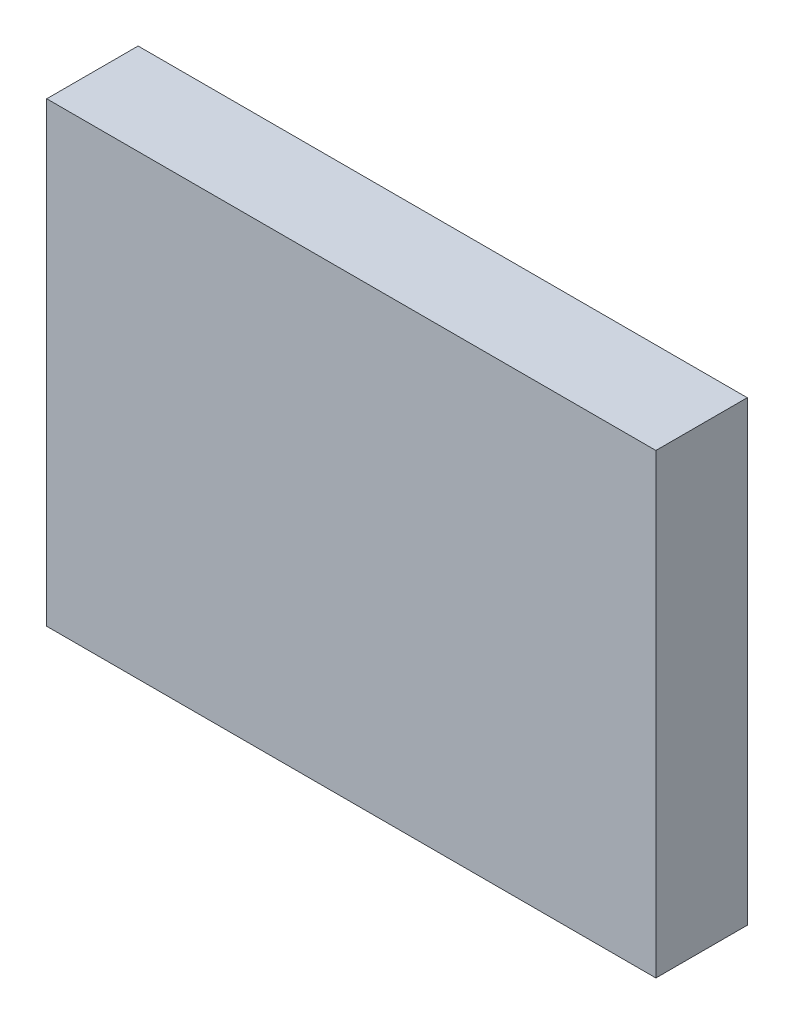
ISO-10303-21;
HEADER;
FILE_DESCRIPTION(('STEP AP214'),'2;1');
FILE_NAME('part.step','',(''),(''),'','','');
FILE_SCHEMA(('AUTOMOTIVE_DESIGN { 1 0 10303 214 1 1 1 1 }'));
ENDSEC;
DATA;
#1=APPLICATION_CONTEXT('core data for automotive mechanical design processes');
#2=APPLICATION_PROTOCOL_DEFINITION('international standard','automotive_design',2000,#1);
#3=PRODUCT_CONTEXT('',#1,'mechanical');
#4=PRODUCT('Part','Part','',(#3));
#5=PRODUCT_RELATED_PRODUCT_CATEGORY('part','',(#4));
#6=PRODUCT_DEFINITION_FORMATION('','',#4);
#7=PRODUCT_DEFINITION_CONTEXT('part definition',#1,'design');
#8=PRODUCT_DEFINITION('design','',#6,#7);
#9=PRODUCT_DEFINITION_SHAPE('','',#8);
#10=(LENGTH_UNIT() NAMED_UNIT(*) SI_UNIT(.MILLI.,.METRE.));
#11=(NAMED_UNIT(*) PLANE_ANGLE_UNIT() SI_UNIT($,.RADIAN.));
#12=(NAMED_UNIT(*) SI_UNIT($,.STERADIAN.) SOLID_ANGLE_UNIT());
#13=UNCERTAINTY_MEASURE_WITH_UNIT(LENGTH_MEASURE(1.E-05),#10,'distance_accuracy_value','');
#14=(GEOMETRIC_REPRESENTATION_CONTEXT(3) GLOBAL_UNCERTAINTY_ASSIGNED_CONTEXT((#13)) GLOBAL_UNIT_ASSIGNED_CONTEXT((#10,
#11,#12)) REPRESENTATION_CONTEXT('',''));
#15=CARTESIAN_POINT('',(0.,0.,0.));
#16=DIRECTION('',(0.,0.,1.));
#17=DIRECTION('',(1.,0.,0.));
#18=AXIS2_PLACEMENT_3D('',#15,#16,#17);
#19=CARTESIAN_POINT('',(0.,0.,6.));
#20=DIRECTION('',(1.,0.,0.));
#21=DIRECTION('',(0.,0.,-1.));
#22=AXIS2_PLACEMENT_3D('',#19,#20,#21);
#23=PLANE('',#22);
#24=DIRECTION('',(0.,-1.,0.));
#25=VECTOR('',#24,1.);
#26=CARTESIAN_POINT('',(0.,0.,0.));
#27=LINE('',#26,#25);
#28=CARTESIAN_POINT('',(0.,30.,0.));
#29=VERTEX_POINT('',#28);
#30=CARTESIAN_POINT('',(0.,0.,0.));
#31=VERTEX_POINT('',#30);
#32=EDGE_CURVE('E102',#29,#31,#27,.T.);
#33=ORIENTED_EDGE('',*,*,#32,.T.);
#34=DIRECTION('',(0.,0.,-1.));
#35=VECTOR('',#34,1.);
#36=CARTESIAN_POINT('',(0.,0.,6.));
#37=LINE('',#36,#35);
#38=CARTESIAN_POINT('',(0.,0.,6.));
#39=VERTEX_POINT('',#38);
#40=EDGE_CURVE('E11',#39,#31,#37,.T.);
#41=ORIENTED_EDGE('',*,*,#40,.F.);
#42=DIRECTION('',(0.,-1.,0.));
#43=VECTOR('',#42,1.);
#44=CARTESIAN_POINT('',(0.,0.,6.));
#45=LINE('',#44,#43);
#46=CARTESIAN_POINT('',(0.,30.,6.));
#47=VERTEX_POINT('',#46);
#48=EDGE_CURVE('E90',#47,#39,#45,.T.);
#49=ORIENTED_EDGE('',*,*,#48,.F.);
#50=DIRECTION('',(0.,0.,-1.));
#51=VECTOR('',#50,1.);
#52=CARTESIAN_POINT('',(0.,30.,6.));
#53=LINE('',#52,#51);
#54=EDGE_CURVE('E98',#47,#29,#53,.T.);
#55=ORIENTED_EDGE('',*,*,#54,.T.);
#56=EDGE_LOOP('',(#33,#41,#49,#55));
#57=FACE_BOUND('',#56,.T.);
#58=ADVANCED_FACE('F39',(#57),#23,.F.);
#59=CARTESIAN_POINT('',(0.,0.,6.));
#60=DIRECTION('',(0.,1.,0.));
#61=DIRECTION('',(0.,0.,1.));
#62=AXIS2_PLACEMENT_3D('',#59,#60,#61);
#63=PLANE('',#62);
#64=DIRECTION('',(1.,0.,0.));
#65=VECTOR('',#64,1.);
#66=CARTESIAN_POINT('',(0.,0.,0.));
#67=LINE('',#66,#65);
#68=CARTESIAN_POINT('',(40.,0.,0.));
#69=VERTEX_POINT('',#68);
#70=EDGE_CURVE('E94',#31,#69,#67,.T.);
#71=ORIENTED_EDGE('',*,*,#70,.T.);
#72=DIRECTION('',(0.,0.,-1.));
#73=VECTOR('',#72,1.);
#74=CARTESIAN_POINT('',(40.,0.,6.));
#75=LINE('',#74,#73);
#76=CARTESIAN_POINT('',(40.,0.,6.));
#77=VERTEX_POINT('',#76);
#78=EDGE_CURVE('E47',#77,#69,#75,.T.);
#79=ORIENTED_EDGE('',*,*,#78,.F.);
#80=DIRECTION('',(1.,0.,0.));
#81=VECTOR('',#80,1.);
#82=CARTESIAN_POINT('',(0.,0.,6.));
#83=LINE('',#82,#81);
#84=EDGE_CURVE('E85',#39,#77,#83,.T.);
#85=ORIENTED_EDGE('',*,*,#84,.F.);
#86=ORIENTED_EDGE('',*,*,#40,.T.);
#87=EDGE_LOOP('',(#71,#79,#85,#86));
#88=FACE_BOUND('',#87,.T.);
#89=ADVANCED_FACE('F93',(#88),#63,.F.);
#90=CARTESIAN_POINT('',(40.,0.,6.));
#91=DIRECTION('',(-1.,0.,0.));
#92=DIRECTION('',(0.,0.,1.));
#93=AXIS2_PLACEMENT_3D('',#90,#91,#92);
#94=PLANE('',#93);
#95=DIRECTION('',(0.,1.,0.));
#96=VECTOR('',#95,1.);
#97=CARTESIAN_POINT('',(40.,0.,0.));
#98=LINE('',#97,#96);
#99=CARTESIAN_POINT('',(40.,30.,0.));
#100=VERTEX_POINT('',#99);
#101=EDGE_CURVE('E72',#69,#100,#98,.T.);
#102=ORIENTED_EDGE('',*,*,#101,.T.);
#103=DIRECTION('',(0.,0.,-1.));
#104=VECTOR('',#103,1.);
#105=CARTESIAN_POINT('',(40.,30.,6.));
#106=LINE('',#105,#104);
#107=CARTESIAN_POINT('',(40.,30.,6.));
#108=VERTEX_POINT('',#107);
#109=EDGE_CURVE('E95',#108,#100,#106,.T.);
#110=ORIENTED_EDGE('',*,*,#109,.F.);
#111=DIRECTION('',(0.,1.,0.));
#112=VECTOR('',#111,1.);
#113=CARTESIAN_POINT('',(40.,0.,6.));
#114=LINE('',#113,#112);
#115=EDGE_CURVE('E88',#77,#108,#114,.T.);
#116=ORIENTED_EDGE('',*,*,#115,.F.);
#117=ORIENTED_EDGE('',*,*,#78,.T.);
#118=EDGE_LOOP('',(#102,#110,#116,#117));
#119=FACE_BOUND('',#118,.T.);
#120=ADVANCED_FACE('F96',(#119),#94,.F.);
#121=CARTESIAN_POINT('',(0.,30.,6.));
#122=DIRECTION('',(0.,-1.,0.));
#123=DIRECTION('',(0.,0.,-1.));
#124=AXIS2_PLACEMENT_3D('',#121,#122,#123);
#125=PLANE('',#124);
#126=DIRECTION('',(-1.,0.,0.));
#127=VECTOR('',#126,1.);
#128=CARTESIAN_POINT('',(0.,30.,0.));
#129=LINE('',#128,#127);
#130=EDGE_CURVE('E78',#100,#29,#129,.T.);
#131=ORIENTED_EDGE('',*,*,#130,.T.);
#132=ORIENTED_EDGE('',*,*,#54,.F.);
#133=DIRECTION('',(-1.,0.,0.));
#134=VECTOR('',#133,1.);
#135=CARTESIAN_POINT('',(0.,30.,6.));
#136=LINE('',#135,#134);
#137=EDGE_CURVE('E55',#108,#47,#136,.T.);
#138=ORIENTED_EDGE('',*,*,#137,.F.);
#139=ORIENTED_EDGE('',*,*,#109,.T.);
#140=EDGE_LOOP('',(#131,#132,#138,#139));
#141=FACE_BOUND('',#140,.T.);
#142=ADVANCED_FACE('F109',(#141),#125,.F.);
#143=CARTESIAN_POINT('',(0.,30.,6.));
#144=DIRECTION('',(0.,0.,-1.));
#145=DIRECTION('',(-1.,0.,0.));
#146=AXIS2_PLACEMENT_3D('',#143,#144,#145);
#147=PLANE('',#146);
#148=ORIENTED_EDGE('',*,*,#48,.T.);
#149=ORIENTED_EDGE('',*,*,#84,.T.);
#150=ORIENTED_EDGE('',*,*,#115,.T.);
#151=ORIENTED_EDGE('',*,*,#137,.T.);
#152=EDGE_LOOP('',(#148,#149,#150,#151));
#153=FACE_BOUND('',#152,.T.);
#154=ADVANCED_FACE('F86',(#153),#147,.F.);
#155=CARTESIAN_POINT('',(0.,30.,0.));
#156=DIRECTION('',(0.,0.,-1.));
#157=DIRECTION('',(-1.,0.,0.));
#158=AXIS2_PLACEMENT_3D('',#155,#156,#157);
#159=PLANE('',#158);
#160=ORIENTED_EDGE('',*,*,#32,.F.);
#161=ORIENTED_EDGE('',*,*,#130,.F.);
#162=ORIENTED_EDGE('',*,*,#101,.F.);
#163=ORIENTED_EDGE('',*,*,#70,.F.);
#164=EDGE_LOOP('',(#160,#161,#162,#163));
#165=FACE_BOUND('',#164,.T.);
#166=ADVANCED_FACE('F112',(#165),#159,.T.);
#167=CLOSED_SHELL('',(#58,#89,#120,#142,#154,#166));
#168=MANIFOLD_SOLID_BREP('B2',#167);
#169=ADVANCED_BREP_SHAPE_REPRESENTATION('',(#18,#168),#14);
#170=SHAPE_DEFINITION_REPRESENTATION(#9,#169);
ENDSEC;
END-ISO-10303-21;
